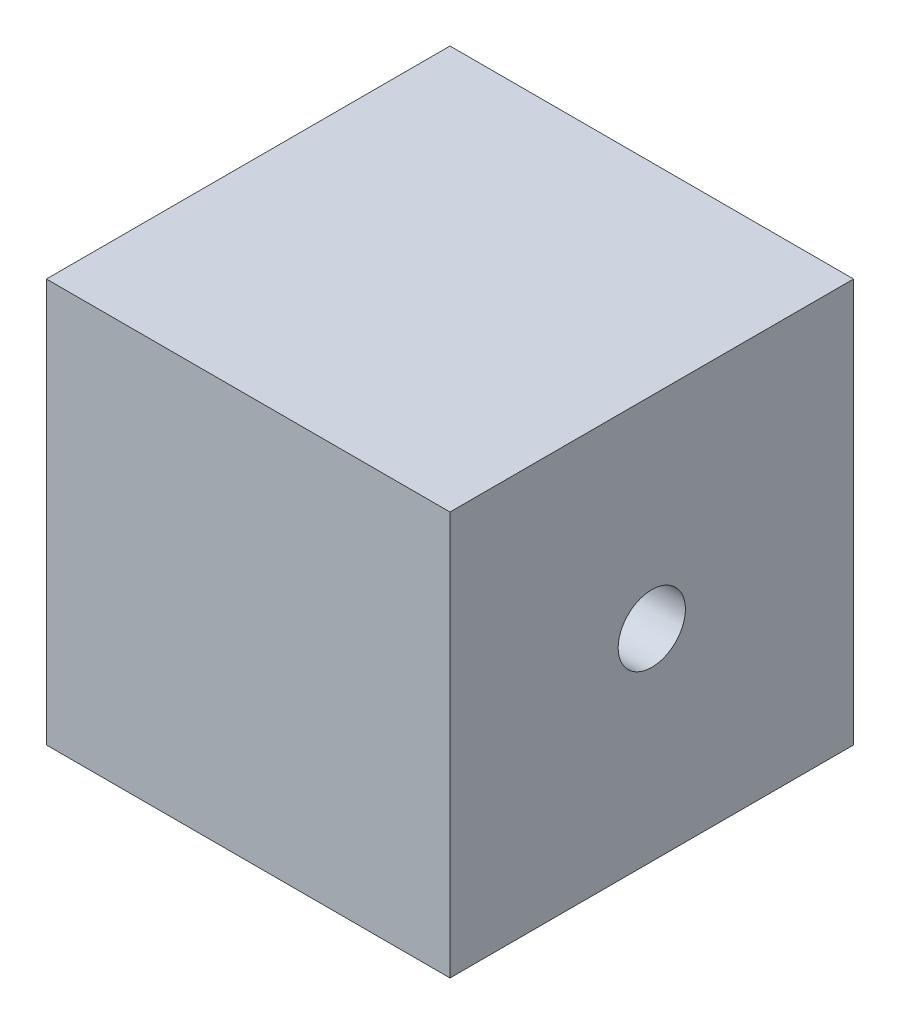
from build123d import *

# Parameters (mm, degrees)
SKETCH1_W           = 152.4
SKETCH1_H           = 152.4
BOSS_EXTRUDE1_DEPTH = 76.2
SKETCH2_R           = 12.7
CUT_EXTRUDE1_DEPTH  = 50.8
SKETCH3_R           = 12.7
CUT_EXTRUDE2_DEPTH  = 187.6511184


with BuildPart() as part:
    # Sketch1 → Boss-Extrude1 (new, symmetric)
    with BuildSketch(Plane(origin=(0, 0, 0), x_dir=(1, 0, 0), z_dir=(0, 1, 0))):
        Rectangle(SKETCH1_W, SKETCH1_H)
    extrude(amount=BOSS_EXTRUDE1_DEPTH, both=True)

    # Sketch2 → Cut-Extrude1 (cut)
    with BuildSketch(Plane.XZ.offset(76.2)):
        with Locations(Location((0, 0, 0), (0, 0, 270))):
            Circle(SKETCH2_R)
    extrude(amount=-CUT_EXTRUDE1_DEPTH, mode=Mode.SUBTRACT)

    # Sketch3 → Cut-Extrude2 (cut, through all)
    with BuildSketch(Plane.ZY.offset(76.2)):
        Circle(SKETCH3_R)
    extrude(amount=-CUT_EXTRUDE2_DEPTH, mode=Mode.SUBTRACT)


solid = part.part
